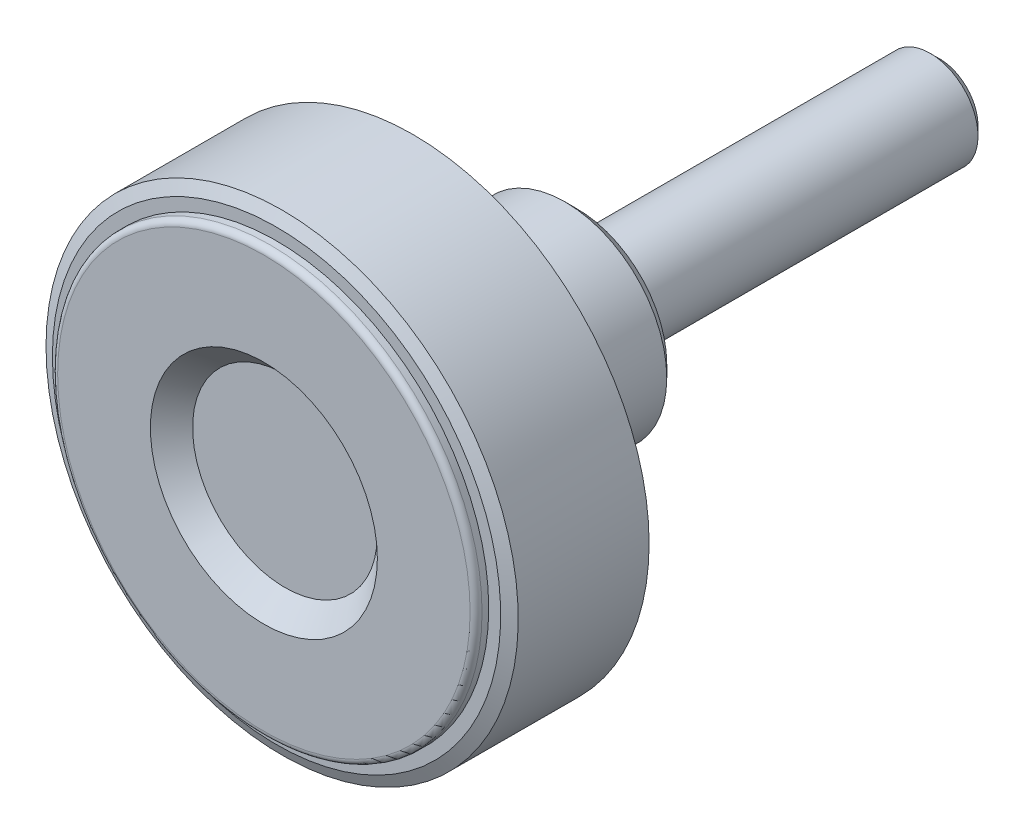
ISO-10303-21;
HEADER;
FILE_DESCRIPTION(('STEP AP214'),'2;1');
FILE_NAME('part.step','',(''),(''),'','','');
FILE_SCHEMA(('AUTOMOTIVE_DESIGN { 1 0 10303 214 1 1 1 1 }'));
ENDSEC;
DATA;
#1=APPLICATION_CONTEXT('core data for automotive mechanical design processes');
#2=APPLICATION_PROTOCOL_DEFINITION('international standard','automotive_design',2000,#1);
#3=PRODUCT_CONTEXT('',#1,'mechanical');
#4=PRODUCT('Part','Part','',(#3));
#5=PRODUCT_RELATED_PRODUCT_CATEGORY('part','',(#4));
#6=PRODUCT_DEFINITION_FORMATION('','',#4);
#7=PRODUCT_DEFINITION_CONTEXT('part definition',#1,'design');
#8=PRODUCT_DEFINITION('design','',#6,#7);
#9=PRODUCT_DEFINITION_SHAPE('','',#8);
#10=(LENGTH_UNIT() NAMED_UNIT(*) SI_UNIT(.MILLI.,.METRE.));
#11=(NAMED_UNIT(*) PLANE_ANGLE_UNIT() SI_UNIT($,.RADIAN.));
#12=(NAMED_UNIT(*) SI_UNIT($,.STERADIAN.) SOLID_ANGLE_UNIT());
#13=UNCERTAINTY_MEASURE_WITH_UNIT(LENGTH_MEASURE(1.E-05),#10,'distance_accuracy_value','');
#14=(GEOMETRIC_REPRESENTATION_CONTEXT(3) GLOBAL_UNCERTAINTY_ASSIGNED_CONTEXT((#13)) GLOBAL_UNIT_ASSIGNED_CONTEXT((#10,
#11,#12)) REPRESENTATION_CONTEXT('',''));
#15=CARTESIAN_POINT('',(0.,0.,0.));
#16=DIRECTION('',(0.,0.,1.));
#17=DIRECTION('',(1.,0.,0.));
#18=AXIS2_PLACEMENT_3D('',#15,#16,#17);
#19=CARTESIAN_POINT('',(0.,0.,-7.1165));
#20=DIRECTION('',(0.,0.,1.));
#21=DIRECTION('',(1.,0.,0.));
#22=AXIS2_PLACEMENT_3D('',#19,#20,#21);
#23=CYLINDRICAL_SURFACE('',#22,4.);
#24=CARTESIAN_POINT('',(0.,0.,-29.233));
#25=DIRECTION('',(0.,0.,-1.));
#26=DIRECTION('',(-1.,0.,0.));
#27=AXIS2_PLACEMENT_3D('',#24,#25,#26);
#28=CIRCLE('',#27,4.);
#29=CARTESIAN_POINT('',(-4.,0.,-29.233));
#30=VERTEX_POINT('',#29);
#31=EDGE_CURVE('E9',#30,#30,#28,.F.);
#32=ORIENTED_EDGE('',*,*,#31,.T.);
#33=EDGE_LOOP('',(#32));
#34=FACE_BOUND('',#33,.T.);
#35=CARTESIAN_POINT('',(0.,0.,0.));
#36=DIRECTION('',(0.,0.,1.));
#37=DIRECTION('',(1.,0.,0.));
#38=AXIS2_PLACEMENT_3D('',#35,#36,#37);
#39=CIRCLE('',#38,4.);
#40=CARTESIAN_POINT('',(4.,0.,0.));
#41=VERTEX_POINT('',#40);
#42=EDGE_CURVE('E212',#41,#41,#39,.T.);
#43=ORIENTED_EDGE('',*,*,#42,.F.);
#44=EDGE_LOOP('',(#43));
#45=FACE_BOUND('',#44,.T.);
#46=ADVANCED_FACE('F14',(#34,#45),#23,.T.);
#47=CARTESIAN_POINT('',(0.,2.66666666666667,0.));
#48=DIRECTION('',(0.,0.,-1.));
#49=DIRECTION('',(-1.,0.,0.));
#50=AXIS2_PLACEMENT_3D('',#47,#48,#49);
#51=PLANE('',#50);
#52=CARTESIAN_POINT('',(0.,0.,0.));
#53=DIRECTION('',(0.,0.,1.));
#54=DIRECTION('',(1.,0.,0.));
#55=AXIS2_PLACEMENT_3D('',#52,#53,#54);
#56=CIRCLE('',#55,5.33333333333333);
#57=CARTESIAN_POINT('',(5.33333333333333,0.,0.));
#58=VERTEX_POINT('',#57);
#59=EDGE_CURVE('E209',#58,#58,#56,.T.);
#60=ORIENTED_EDGE('',*,*,#59,.F.);
#61=EDGE_LOOP('',(#60));
#62=FACE_BOUND('',#61,.T.);
#63=ORIENTED_EDGE('',*,*,#42,.T.);
#64=EDGE_LOOP('',(#63));
#65=FACE_BOUND('',#64,.T.);
#66=ADVANCED_FACE('F402',(#62,#65),#51,.T.);
#67=CARTESIAN_POINT('',(0.,0.,0.15));
#68=DIRECTION('',(0.,0.,1.));
#69=DIRECTION('',(1.,0.,0.));
#70=AXIS2_PLACEMENT_3D('',#67,#68,#69);
#71=CYLINDRICAL_SURFACE('',#70,5.33333333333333);
#72=ORIENTED_EDGE('',*,*,#59,.T.);
#73=EDGE_LOOP('',(#72));
#74=FACE_BOUND('',#73,.T.);
#75=CARTESIAN_POINT('',(0.,0.,0.3));
#76=DIRECTION('',(0.,0.,1.));
#77=DIRECTION('',(1.,0.,0.));
#78=AXIS2_PLACEMENT_3D('',#75,#76,#77);
#79=CIRCLE('',#78,5.33333333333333);
#80=CARTESIAN_POINT('',(5.33333333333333,0.,0.3));
#81=VERTEX_POINT('',#80);
#82=EDGE_CURVE('E206',#81,#81,#79,.T.);
#83=ORIENTED_EDGE('',*,*,#82,.F.);
#84=EDGE_LOOP('',(#83));
#85=FACE_BOUND('',#84,.T.);
#86=ADVANCED_FACE('F406',(#74,#85),#71,.T.);
#87=CARTESIAN_POINT('',(0.,6.41666666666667,0.3));
#88=DIRECTION('',(0.,0.,-1.));
#89=DIRECTION('',(-1.,0.,0.));
#90=AXIS2_PLACEMENT_3D('',#87,#88,#89);
#91=PLANE('',#90);
#92=CARTESIAN_POINT('',(0.,0.,0.3));
#93=DIRECTION('',(0.,0.,1.));
#94=DIRECTION('',(1.,0.,0.));
#95=AXIS2_PLACEMENT_3D('',#92,#93,#94);
#96=CIRCLE('',#95,7.5);
#97=CARTESIAN_POINT('',(7.5,0.,0.3));
#98=VERTEX_POINT('',#97);
#99=EDGE_CURVE('E175',#98,#98,#96,.T.);
#100=ORIENTED_EDGE('',*,*,#99,.F.);
#101=EDGE_LOOP('',(#100));
#102=FACE_BOUND('',#101,.T.);
#103=ORIENTED_EDGE('',*,*,#82,.T.);
#104=EDGE_LOOP('',(#103));
#105=FACE_BOUND('',#104,.T.);
#106=ADVANCED_FACE('F413',(#102,#105),#91,.T.);
#107=CARTESIAN_POINT('',(0.,0.,1.3));
#108=DIRECTION('',(0.,0.,1.));
#109=DIRECTION('',(1.,0.,0.));
#110=AXIS2_PLACEMENT_3D('',#107,#108,#109);
#111=CONICAL_SURFACE('',#110,8.5,0.785398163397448);
#112=ORIENTED_EDGE('',*,*,#99,.T.);
#113=EDGE_LOOP('',(#112));
#114=FACE_BOUND('',#113,.T.);
#115=CARTESIAN_POINT('',(0.,0.,1.3));
#116=DIRECTION('',(0.,0.,1.));
#117=DIRECTION('',(1.,0.,0.));
#118=AXIS2_PLACEMENT_3D('',#115,#116,#117);
#119=CIRCLE('',#118,8.5);
#120=CARTESIAN_POINT('',(8.5,0.,1.3));
#121=VERTEX_POINT('',#120);
#122=EDGE_CURVE('E172',#121,#121,#119,.T.);
#123=ORIENTED_EDGE('',*,*,#122,.F.);
#124=EDGE_LOOP('',(#123));
#125=FACE_BOUND('',#124,.T.);
#126=ADVANCED_FACE('F420',(#114,#125),#111,.T.);
#127=CARTESIAN_POINT('',(0.,0.,11.1916666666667));
#128=DIRECTION('',(0.,0.,1.));
#129=DIRECTION('',(1.,0.,0.));
#130=AXIS2_PLACEMENT_3D('',#127,#128,#129);
#131=CYLINDRICAL_SURFACE('',#130,8.5);
#132=ORIENTED_EDGE('',*,*,#122,.T.);
#133=EDGE_LOOP('',(#132));
#134=FACE_BOUND('',#133,.T.);
#135=CARTESIAN_POINT('',(0.,0.,21.0833333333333));
#136=DIRECTION('',(0.,0.,-1.));
#137=DIRECTION('',(-1.,0.,0.));
#138=AXIS2_PLACEMENT_3D('',#135,#136,#137);
#139=CIRCLE('',#138,8.5);
#140=CARTESIAN_POINT('',(-8.5,0.,21.0833333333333));
#141=VERTEX_POINT('',#140);
#142=EDGE_CURVE('E75',#141,#141,#139,.T.);
#143=ORIENTED_EDGE('',*,*,#142,.T.);
#144=EDGE_LOOP('',(#143));
#145=FACE_BOUND('',#144,.T.);
#146=ADVANCED_FACE('F423',(#134,#145),#131,.T.);
#147=CARTESIAN_POINT('',(0.,0.,21.0833333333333));
#148=DIRECTION('',(0.,0.,-1.));
#149=DIRECTION('',(-1.,0.,0.));
#150=AXIS2_PLACEMENT_3D('',#147,#148,#149);
#151=TOROIDAL_SURFACE('',#150,9.5,1.);
#152=CARTESIAN_POINT('',(0.,0.,22.0833333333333));
#153=DIRECTION('',(0.,0.,-1.));
#154=DIRECTION('',(1.,0.,0.));
#155=AXIS2_PLACEMENT_3D('',#152,#153,#154);
#156=CIRCLE('',#155,9.5);
#157=CARTESIAN_POINT('',(-9.5,0.,22.0833333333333));
#158=VERTEX_POINT('',#157);
#159=CARTESIAN_POINT('',(9.5,0.,22.0833333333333));
#160=VERTEX_POINT('',#159);
#161=EDGE_CURVE('E68',#158,#160,#156,.F.);
#162=ORIENTED_EDGE('',*,*,#161,.F.);
#163=CARTESIAN_POINT('',(0.,0.,22.0833333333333));
#164=DIRECTION('',(0.,0.,-1.));
#165=DIRECTION('',(-1.,0.,0.));
#166=AXIS2_PLACEMENT_3D('',#163,#164,#165);
#167=CIRCLE('',#166,9.5);
#168=CARTESIAN_POINT('',(0.,9.5,22.0833333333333));
#169=VERTEX_POINT('',#168);
#170=EDGE_CURVE('E71',#169,#158,#167,.F.);
#171=ORIENTED_EDGE('',*,*,#170,.F.);
#172=CARTESIAN_POINT('',(0.,0.,22.0833333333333));
#173=DIRECTION('',(0.,0.,-1.));
#174=DIRECTION('',(0.,1.,0.));
#175=AXIS2_PLACEMENT_3D('',#172,#173,#174);
#176=CIRCLE('',#175,9.5);
#177=EDGE_CURVE('E63',#160,#169,#176,.F.);
#178=ORIENTED_EDGE('',*,*,#177,.F.);
#179=EDGE_LOOP('',(#162,#171,#178));
#180=FACE_BOUND('',#179,.T.);
#181=ORIENTED_EDGE('',*,*,#142,.F.);
#182=EDGE_LOOP('',(#181));
#183=FACE_BOUND('',#182,.T.);
#184=ADVANCED_FACE('F66',(#180,#183),#151,.F.);
#185=CARTESIAN_POINT('',(0.,11.8461538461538,22.0833333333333));
#186=DIRECTION('',(0.,0.,-1.));
#187=DIRECTION('',(-1.,0.,0.));
#188=AXIS2_PLACEMENT_3D('',#185,#186,#187);
#189=PLANE('',#188);
#190=CARTESIAN_POINT('',(0.,0.,22.0833333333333));
#191=DIRECTION('',(0.,0.,1.));
#192=DIRECTION('',(-1.,0.,0.));
#193=AXIS2_PLACEMENT_3D('',#190,#191,#192);
#194=CIRCLE('',#193,14.1923076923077);
#195=CARTESIAN_POINT('',(14.1923076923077,0.,22.0833333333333));
#196=VERTEX_POINT('',#195);
#197=CARTESIAN_POINT('',(-14.1923076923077,0.,22.0833333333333));
#198=VERTEX_POINT('',#197);
#199=EDGE_CURVE('E81',#196,#198,#194,.F.);
#200=ORIENTED_EDGE('',*,*,#199,.T.);
#201=CARTESIAN_POINT('',(0.,0.,22.0833333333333));
#202=DIRECTION('',(0.,0.,1.));
#203=DIRECTION('',(0.,1.,0.));
#204=AXIS2_PLACEMENT_3D('',#201,#202,#203);
#205=CIRCLE('',#204,14.1923076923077);
#206=CARTESIAN_POINT('',(0.,14.1923076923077,22.0833333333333));
#207=VERTEX_POINT('',#206);
#208=EDGE_CURVE('E130',#198,#207,#205,.F.);
#209=ORIENTED_EDGE('',*,*,#208,.T.);
#210=CARTESIAN_POINT('',(0.,0.,22.0833333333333));
#211=DIRECTION('',(0.,0.,1.));
#212=DIRECTION('',(1.,0.,0.));
#213=AXIS2_PLACEMENT_3D('',#210,#211,#212);
#214=CIRCLE('',#213,14.1923076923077);
#215=EDGE_CURVE('E143',#207,#196,#214,.F.);
#216=ORIENTED_EDGE('',*,*,#215,.T.);
#217=EDGE_LOOP('',(#200,#209,#216));
#218=FACE_BOUND('',#217,.T.);
#219=ORIENTED_EDGE('',*,*,#170,.T.);
#220=ORIENTED_EDGE('',*,*,#161,.T.);
#221=ORIENTED_EDGE('',*,*,#177,.T.);
#222=EDGE_LOOP('',(#219,#220,#221));
#223=FACE_BOUND('',#222,.T.);
#224=ADVANCED_FACE('F79',(#218,#223),#189,.T.);
#225=CARTESIAN_POINT('',(0.,0.,21.0833333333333));
#226=DIRECTION('',(0.,0.,-1.));
#227=DIRECTION('',(-1.,0.,0.));
#228=AXIS2_PLACEMENT_3D('',#225,#226,#227);
#229=TOROIDAL_SURFACE('',#228,14.1923076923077,1.);
#230=ORIENTED_EDGE('',*,*,#208,.F.);
#231=ORIENTED_EDGE('',*,*,#199,.F.);
#232=ORIENTED_EDGE('',*,*,#215,.F.);
#233=EDGE_LOOP('',(#230,#231,#232));
#234=FACE_BOUND('',#233,.T.);
#235=CARTESIAN_POINT('',(0.,0.,21.0833333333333));
#236=DIRECTION('',(0.,0.,1.));
#237=DIRECTION('',(1.,0.,0.));
#238=AXIS2_PLACEMENT_3D('',#235,#236,#237);
#239=CIRCLE('',#238,15.1923076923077);
#240=CARTESIAN_POINT('',(15.1923076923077,0.,21.0833333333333));
#241=VERTEX_POINT('',#240);
#242=EDGE_CURVE('E203',#241,#241,#239,.F.);
#243=ORIENTED_EDGE('',*,*,#242,.T.);
#244=EDGE_LOOP('',(#243));
#245=FACE_BOUND('',#244,.T.);
#246=ADVANCED_FACE('F100',(#234,#245),#229,.F.);
#247=CARTESIAN_POINT('',(0.,0.,16.7916666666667));
#248=DIRECTION('',(0.,0.,1.));
#249=DIRECTION('',(1.,0.,0.));
#250=AXIS2_PLACEMENT_3D('',#247,#248,#249);
#251=CYLINDRICAL_SURFACE('',#250,15.1923076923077);
#252=ORIENTED_EDGE('',*,*,#242,.F.);
#253=EDGE_LOOP('',(#252));
#254=FACE_BOUND('',#253,.T.);
#255=CARTESIAN_POINT('',(0.,0.,12.5));
#256=DIRECTION('',(0.,0.,1.));
#257=DIRECTION('',(1.,0.,0.));
#258=AXIS2_PLACEMENT_3D('',#255,#256,#257);
#259=CIRCLE('',#258,15.1923076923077);
#260=CARTESIAN_POINT('',(15.1923076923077,0.,12.5));
#261=VERTEX_POINT('',#260);
#262=EDGE_CURVE('E199',#261,#261,#259,.T.);
#263=ORIENTED_EDGE('',*,*,#262,.F.);
#264=EDGE_LOOP('',(#263));
#265=FACE_BOUND('',#264,.T.);
#266=ADVANCED_FACE('F326',(#254,#265),#251,.F.);
#267=CARTESIAN_POINT('',(0.,16.2211538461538,12.5));
#268=DIRECTION('',(0.,0.,-1.));
#269=DIRECTION('',(-1.,0.,0.));
#270=AXIS2_PLACEMENT_3D('',#267,#268,#269);
#271=PLANE('',#270);
#272=CARTESIAN_POINT('',(0.,0.,12.5));
#273=DIRECTION('',(0.,0.,1.));
#274=DIRECTION('',(-1.,0.,0.));
#275=AXIS2_PLACEMENT_3D('',#272,#273,#274);
#276=CIRCLE('',#275,17.25);
#277=CARTESIAN_POINT('',(-17.25,0.,12.5));
#278=VERTEX_POINT('',#277);
#279=CARTESIAN_POINT('',(17.25,0.,12.5));
#280=VERTEX_POINT('',#279);
#281=EDGE_CURVE('E261',#278,#280,#276,.T.);
#282=ORIENTED_EDGE('',*,*,#281,.F.);
#283=CARTESIAN_POINT('',(0.,0.,12.5));
#284=DIRECTION('',(0.,0.,1.));
#285=DIRECTION('',(0.,1.,0.));
#286=AXIS2_PLACEMENT_3D('',#283,#284,#285);
#287=CIRCLE('',#286,17.25);
#288=CARTESIAN_POINT('',(0.,17.25,12.5));
#289=VERTEX_POINT('',#288);
#290=EDGE_CURVE('E296',#289,#278,#287,.T.);
#291=ORIENTED_EDGE('',*,*,#290,.F.);
#292=CARTESIAN_POINT('',(0.,0.,12.5));
#293=DIRECTION('',(0.,0.,1.));
#294=DIRECTION('',(1.,0.,0.));
#295=AXIS2_PLACEMENT_3D('',#292,#293,#294);
#296=CIRCLE('',#295,17.25);
#297=EDGE_CURVE('E202',#280,#289,#296,.T.);
#298=ORIENTED_EDGE('',*,*,#297,.F.);
#299=EDGE_LOOP('',(#282,#291,#298));
#300=FACE_BOUND('',#299,.T.);
#301=ORIENTED_EDGE('',*,*,#262,.T.);
#302=EDGE_LOOP('',(#301));
#303=FACE_BOUND('',#302,.T.);
#304=ADVANCED_FACE('F272',(#300,#303),#271,.T.);
#305=CARTESIAN_POINT('',(0.,0.,13.));
#306=DIRECTION('',(0.,0.,-1.));
#307=DIRECTION('',(-1.,0.,0.));
#308=AXIS2_PLACEMENT_3D('',#305,#306,#307);
#309=TOROIDAL_SURFACE('',#308,17.25,0.5);
#310=ORIENTED_EDGE('',*,*,#290,.T.);
#311=ORIENTED_EDGE('',*,*,#281,.T.);
#312=ORIENTED_EDGE('',*,*,#297,.T.);
#313=EDGE_LOOP('',(#310,#311,#312));
#314=FACE_BOUND('',#313,.T.);
#315=CARTESIAN_POINT('',(0.,0.,13.));
#316=DIRECTION('',(0.,0.,1.));
#317=DIRECTION('',(1.,0.,0.));
#318=AXIS2_PLACEMENT_3D('',#315,#316,#317);
#319=CIRCLE('',#318,17.75);
#320=CARTESIAN_POINT('',(17.75,0.,13.));
#321=VERTEX_POINT('',#320);
#322=EDGE_CURVE('E198',#321,#321,#319,.T.);
#323=ORIENTED_EDGE('',*,*,#322,.F.);
#324=EDGE_LOOP('',(#323));
#325=FACE_BOUND('',#324,.T.);
#326=ADVANCED_FACE('F266',(#314,#325),#309,.T.);
#327=CARTESIAN_POINT('',(0.,0.,13.28));
#328=DIRECTION('',(0.,0.,1.));
#329=DIRECTION('',(1.,0.,0.));
#330=AXIS2_PLACEMENT_3D('',#327,#328,#329);
#331=CYLINDRICAL_SURFACE('',#330,17.75);
#332=ORIENTED_EDGE('',*,*,#322,.T.);
#333=EDGE_LOOP('',(#332));
#334=FACE_BOUND('',#333,.T.);
#335=CARTESIAN_POINT('',(0.,0.,13.56));
#336=DIRECTION('',(0.,0.,1.));
#337=DIRECTION('',(1.,0.,0.));
#338=AXIS2_PLACEMENT_3D('',#335,#336,#337);
#339=CIRCLE('',#338,17.75);
#340=CARTESIAN_POINT('',(17.75,0.,13.56));
#341=VERTEX_POINT('',#340);
#342=EDGE_CURVE('E195',#341,#341,#339,.T.);
#343=ORIENTED_EDGE('',*,*,#342,.F.);
#344=EDGE_LOOP('',(#343));
#345=FACE_BOUND('',#344,.T.);
#346=ADVANCED_FACE('F271',(#334,#345),#331,.T.);
#347=CARTESIAN_POINT('',(0.,18.25,13.56));
#348=DIRECTION('',(0.,0.,-1.));
#349=DIRECTION('',(-1.,0.,0.));
#350=AXIS2_PLACEMENT_3D('',#347,#348,#349);
#351=PLANE('',#350);
#352=CARTESIAN_POINT('',(0.,0.,13.56));
#353=DIRECTION('',(0.,0.,1.));
#354=DIRECTION('',(1.,0.,0.));
#355=AXIS2_PLACEMENT_3D('',#352,#353,#354);
#356=CIRCLE('',#355,18.75);
#357=CARTESIAN_POINT('',(18.75,0.,13.56));
#358=VERTEX_POINT('',#357);
#359=EDGE_CURVE('E191',#358,#358,#356,.T.);
#360=ORIENTED_EDGE('',*,*,#359,.F.);
#361=EDGE_LOOP('',(#360));
#362=FACE_BOUND('',#361,.T.);
#363=ORIENTED_EDGE('',*,*,#342,.T.);
#364=EDGE_LOOP('',(#363));
#365=FACE_BOUND('',#364,.T.);
#366=ADVANCED_FACE('F339',(#362,#365),#351,.T.);
#367=CARTESIAN_POINT('',(0.,0.,14.026307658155));
#368=DIRECTION('',(0.,0.,1.));
#369=DIRECTION('',(1.,0.,0.));
#370=AXIS2_PLACEMENT_3D('',#367,#368,#369);
#371=CONICAL_SURFACE('',#370,19.75,1.13446401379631);
#372=CARTESIAN_POINT('',(-1.50102152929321E-13,-1.52766688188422E-12,14.026307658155));
#373=DIRECTION('',(0.,0.,-1.));
#374=DIRECTION('',(-1.,0.,0.));
#375=AXIS2_PLACEMENT_3D('',#372,#373,#374);
#376=CIRCLE('',#375,19.7500000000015);
#377=CARTESIAN_POINT('',(-19.7500000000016,-1.52766688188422E-12,14.026307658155));
#378=VERTEX_POINT('',#377);
#379=EDGE_CURVE('E194',#378,#378,#376,.F.);
#380=ORIENTED_EDGE('',*,*,#379,.F.);
#381=EDGE_LOOP('',(#380));
#382=FACE_BOUND('',#381,.T.);
#383=ORIENTED_EDGE('',*,*,#359,.T.);
#384=EDGE_LOOP('',(#383));
#385=FACE_BOUND('',#384,.T.);
#386=ADVANCED_FACE('F337',(#382,#385),#371,.T.);
#387=CARTESIAN_POINT('',(0.,3.86363636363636,24.7333333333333));
#388=DIRECTION('',(0.,0.,1.));
#389=DIRECTION('',(1.,0.,0.));
#390=AXIS2_PLACEMENT_3D('',#387,#388,#389);
#391=PLANE('',#390);
#392=CARTESIAN_POINT('',(0.,0.,24.7333333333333));
#393=DIRECTION('',(0.,0.,1.));
#394=DIRECTION('',(1.,0.,0.));
#395=AXIS2_PLACEMENT_3D('',#392,#393,#394);
#396=CIRCLE('',#395,7.7272727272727);
#397=CARTESIAN_POINT('',(7.7272727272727,0.,24.7333333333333));
#398=VERTEX_POINT('',#397);
#399=EDGE_CURVE('E179',#398,#398,#396,.T.);
#400=ORIENTED_EDGE('',*,*,#399,.T.);
#401=EDGE_LOOP('',(#400));
#402=FACE_BOUND('',#401,.T.);
#403=ADVANCED_FACE('F239',(#402),#391,.T.);
#404=CARTESIAN_POINT('',(0.,0.,26.5));
#405=DIRECTION('',(0.,0.,1.));
#406=DIRECTION('',(1.,0.,0.));
#407=AXIS2_PLACEMENT_3D('',#404,#405,#406);
#408=CONICAL_SURFACE('',#407,9.49393939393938,0.785398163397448);
#409=CARTESIAN_POINT('',(0.,0.,26.5));
#410=DIRECTION('',(0.,0.,1.));
#411=DIRECTION('',(1.,0.,0.));
#412=AXIS2_PLACEMENT_3D('',#409,#410,#411);
#413=CIRCLE('',#412,9.49393939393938);
#414=CARTESIAN_POINT('',(9.49393939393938,0.,26.5));
#415=VERTEX_POINT('',#414);
#416=EDGE_CURVE('E176',#415,#415,#413,.F.);
#417=ORIENTED_EDGE('',*,*,#416,.F.);
#418=EDGE_LOOP('',(#417));
#419=FACE_BOUND('',#418,.T.);
#420=ORIENTED_EDGE('',*,*,#399,.F.);
#421=EDGE_LOOP('',(#420));
#422=FACE_BOUND('',#421,.T.);
#423=ADVANCED_FACE('F237',(#419,#422),#408,.F.);
#424=CARTESIAN_POINT('',(0.,13.3719696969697,26.5));
#425=DIRECTION('',(0.,0.,1.));
#426=DIRECTION('',(1.,0.,0.));
#427=AXIS2_PLACEMENT_3D('',#424,#425,#426);
#428=PLANE('',#427);
#429=ORIENTED_EDGE('',*,*,#416,.T.);
#430=EDGE_LOOP('',(#429));
#431=FACE_BOUND('',#430,.T.);
#432=CARTESIAN_POINT('',(0.,0.,26.5));
#433=DIRECTION('',(0.,0.,-1.));
#434=DIRECTION('',(-1.,0.,0.));
#435=AXIS2_PLACEMENT_3D('',#432,#433,#434);
#436=CIRCLE('',#435,17.25);
#437=CARTESIAN_POINT('',(0.,17.25,26.5));
#438=VERTEX_POINT('',#437);
#439=CARTESIAN_POINT('',(-17.25,0.,26.5));
#440=VERTEX_POINT('',#439);
#441=EDGE_CURVE('E216',#438,#440,#436,.F.);
#442=ORIENTED_EDGE('',*,*,#441,.T.);
#443=CARTESIAN_POINT('',(0.,0.,26.5));
#444=DIRECTION('',(0.,0.,-1.));
#445=DIRECTION('',(1.,0.,0.));
#446=AXIS2_PLACEMENT_3D('',#443,#444,#445);
#447=CIRCLE('',#446,17.25);
#448=CARTESIAN_POINT('',(17.25,0.,26.5));
#449=VERTEX_POINT('',#448);
#450=EDGE_CURVE('E31',#440,#449,#447,.F.);
#451=ORIENTED_EDGE('',*,*,#450,.T.);
#452=CARTESIAN_POINT('',(0.,0.,26.5));
#453=DIRECTION('',(0.,0.,-1.));
#454=DIRECTION('',(0.,1.,0.));
#455=AXIS2_PLACEMENT_3D('',#452,#453,#454);
#456=CIRCLE('',#455,17.25);
#457=EDGE_CURVE('E182',#449,#438,#456,.F.);
#458=ORIENTED_EDGE('',*,*,#457,.T.);
#459=EDGE_LOOP('',(#442,#451,#458));
#460=FACE_BOUND('',#459,.T.);
#461=ADVANCED_FACE('F235',(#431,#460),#428,.T.);
#462=CARTESIAN_POINT('',(0.,0.,26.));
#463=DIRECTION('',(0.,0.,-1.));
#464=DIRECTION('',(-1.,0.,0.));
#465=AXIS2_PLACEMENT_3D('',#462,#463,#464);
#466=TOROIDAL_SURFACE('',#465,17.25,0.5);
#467=CARTESIAN_POINT('',(0.,0.,26.));
#468=DIRECTION('',(0.,0.,-1.));
#469=DIRECTION('',(-1.,0.,0.));
#470=AXIS2_PLACEMENT_3D('',#467,#468,#469);
#471=CIRCLE('',#470,17.75);
#472=CARTESIAN_POINT('',(-17.75,0.,26.));
#473=VERTEX_POINT('',#472);
#474=EDGE_CURVE('E183',#473,#473,#471,.F.);
#475=ORIENTED_EDGE('',*,*,#474,.T.);
#476=EDGE_LOOP('',(#475));
#477=FACE_BOUND('',#476,.T.);
#478=ORIENTED_EDGE('',*,*,#450,.F.);
#479=ORIENTED_EDGE('',*,*,#441,.F.);
#480=ORIENTED_EDGE('',*,*,#457,.F.);
#481=EDGE_LOOP('',(#478,#479,#480));
#482=FACE_BOUND('',#481,.T.);
#483=ADVANCED_FACE('F223',(#477,#482),#466,.T.);
#484=CARTESIAN_POINT('',(0.,0.,25.72));
#485=DIRECTION('',(0.,0.,1.));
#486=DIRECTION('',(1.,0.,0.));
#487=AXIS2_PLACEMENT_3D('',#484,#485,#486);
#488=CYLINDRICAL_SURFACE('',#487,17.75);
#489=ORIENTED_EDGE('',*,*,#474,.F.);
#490=EDGE_LOOP('',(#489));
#491=FACE_BOUND('',#490,.T.);
#492=CARTESIAN_POINT('',(0.,0.,25.44));
#493=DIRECTION('',(0.,0.,1.));
#494=DIRECTION('',(1.,0.,0.));
#495=AXIS2_PLACEMENT_3D('',#492,#493,#494);
#496=CIRCLE('',#495,17.75);
#497=CARTESIAN_POINT('',(17.75,0.,25.44));
#498=VERTEX_POINT('',#497);
#499=EDGE_CURVE('E184',#498,#498,#496,.T.);
#500=ORIENTED_EDGE('',*,*,#499,.T.);
#501=EDGE_LOOP('',(#500));
#502=FACE_BOUND('',#501,.T.);
#503=ADVANCED_FACE('F234',(#491,#502),#488,.T.);
#504=CARTESIAN_POINT('',(0.,0.,24.973692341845));
#505=DIRECTION('',(0.,0.,-1.));
#506=DIRECTION('',(-1.,0.,0.));
#507=AXIS2_PLACEMENT_3D('',#504,#505,#506);
#508=CONICAL_SURFACE('',#507,19.75,1.13446401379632);
#509=CARTESIAN_POINT('',(0.,0.,25.44));
#510=DIRECTION('',(0.,0.,-1.));
#511=DIRECTION('',(-1.,0.,0.));
#512=AXIS2_PLACEMENT_3D('',#509,#510,#511);
#513=CIRCLE('',#512,18.75);
#514=CARTESIAN_POINT('',(-18.75,0.,25.44));
#515=VERTEX_POINT('',#514);
#516=EDGE_CURVE('E187',#515,#515,#513,.F.);
#517=ORIENTED_EDGE('',*,*,#516,.F.);
#518=EDGE_LOOP('',(#517));
#519=FACE_BOUND('',#518,.T.);
#520=CARTESIAN_POINT('',(0.,0.,24.973692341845));
#521=DIRECTION('',(0.,0.,-1.));
#522=DIRECTION('',(0.,1.,0.));
#523=AXIS2_PLACEMENT_3D('',#520,#521,#522);
#524=CIRCLE('',#523,19.75);
#525=CARTESIAN_POINT('',(0.,19.75,24.973692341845));
#526=VERTEX_POINT('',#525);
#527=EDGE_CURVE('E190',#526,#526,#524,.F.);
#528=ORIENTED_EDGE('',*,*,#527,.T.);
#529=EDGE_LOOP('',(#528));
#530=FACE_BOUND('',#529,.T.);
#531=ADVANCED_FACE('F358',(#519,#530),#508,.T.);
#532=CARTESIAN_POINT('',(0.,18.25,25.44));
#533=DIRECTION('',(0.,0.,1.));
#534=DIRECTION('',(1.,0.,0.));
#535=AXIS2_PLACEMENT_3D('',#532,#533,#534);
#536=PLANE('',#535);
#537=ORIENTED_EDGE('',*,*,#499,.F.);
#538=EDGE_LOOP('',(#537));
#539=FACE_BOUND('',#538,.T.);
#540=ORIENTED_EDGE('',*,*,#516,.T.);
#541=EDGE_LOOP('',(#540));
#542=FACE_BOUND('',#541,.T.);
#543=ADVANCED_FACE('F356',(#539,#542),#536,.T.);
#544=CARTESIAN_POINT('',(-1.50102152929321E-13,-1.52766688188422E-12,0.));
#545=DIRECTION('',(0.,0.,-1.));
#546=DIRECTION('',(-1.,0.,0.));
#547=AXIS2_PLACEMENT_3D('',#544,#545,#546);
#548=CYLINDRICAL_SURFACE('',#547,19.7500000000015);
#549=ORIENTED_EDGE('',*,*,#379,.T.);
#550=EDGE_LOOP('',(#549));
#551=FACE_BOUND('',#550,.T.);
#552=ORIENTED_EDGE('',*,*,#527,.F.);
#553=EDGE_LOOP('',(#552));
#554=FACE_BOUND('',#553,.T.);
#555=ADVANCED_FACE('F352',(#551,#554),#548,.T.);
#556=CARTESIAN_POINT('',(0.,0.,-30.));
#557=DIRECTION('',(0.,0.,-1.));
#558=DIRECTION('',(-1.,0.,0.));
#559=AXIS2_PLACEMENT_3D('',#556,#557,#558);
#560=PLANE('',#559);
#561=CARTESIAN_POINT('',(0.,0.,-30.));
#562=DIRECTION('',(0.,0.,-1.));
#563=DIRECTION('',(-1.,0.,0.));
#564=AXIS2_PLACEMENT_3D('',#561,#562,#563);
#565=CIRCLE('',#564,3.233);
#566=CARTESIAN_POINT('',(-3.233,0.,-30.));
#567=VERTEX_POINT('',#566);
#568=EDGE_CURVE('E23',#567,#567,#565,.T.);
#569=ORIENTED_EDGE('',*,*,#568,.T.);
#570=EDGE_LOOP('',(#569));
#571=FACE_BOUND('',#570,.T.);
#572=ADVANCED_FACE('F355',(#571),#560,.T.);
#573=CARTESIAN_POINT('',(0.,0.,-30.));
#574=DIRECTION('',(0.,0.,1.));
#575=DIRECTION('',(1.,0.,0.));
#576=AXIS2_PLACEMENT_3D('',#573,#574,#575);
#577=CONICAL_SURFACE('',#576,3.233,0.785398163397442);
#578=ORIENTED_EDGE('',*,*,#31,.F.);
#579=EDGE_LOOP('',(#578));
#580=FACE_BOUND('',#579,.T.);
#581=ORIENTED_EDGE('',*,*,#568,.F.);
#582=EDGE_LOOP('',(#581));
#583=FACE_BOUND('',#582,.T.);
#584=ADVANCED_FACE('F16',(#580,#583),#577,.T.);
#585=CLOSED_SHELL('',(#46,#66,#86,#106,#126,#146,#184,#224,#246,#266,#304,#326,#346,#366,#386,
#403,#423,#461,#483,#503,#531,#543,#555,#572,#584));
#586=MANIFOLD_SOLID_BREP('B1',#585);
#587=ADVANCED_BREP_SHAPE_REPRESENTATION('',(#18,#586),#14);
#588=SHAPE_DEFINITION_REPRESENTATION(#9,#587);
ENDSEC;
END-ISO-10303-21;
